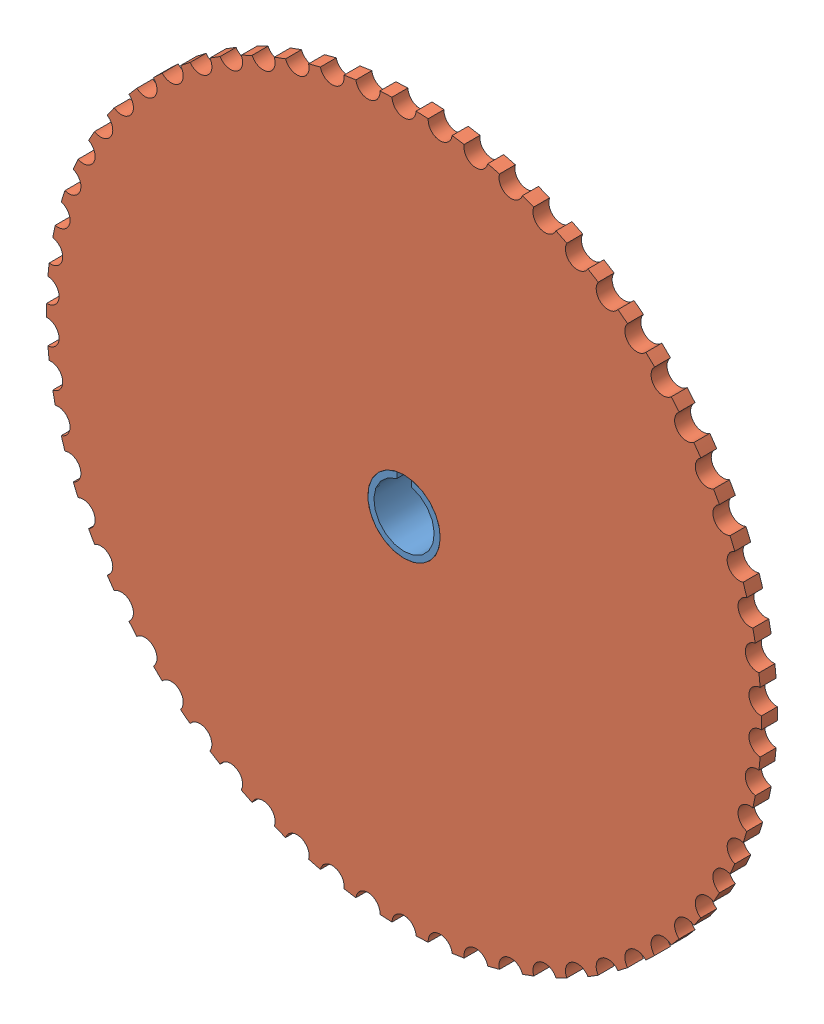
SolidWorks assembly Gear Sub-assembly.SLDASM, configuration Default (file format 4400). Lengths in mm.
Overall size (187.96 187.85 11.81).
3 component instances, 3 part files, 4 mates.
Components (placement in the parent):
- Gear Bracket-1: Gear Bracket.SLDPRT [Default] at (-7.665 3.1375 7.8187) size (38.1 38.1 11.81)
- Gear Assy Weld-1: Gear Assy Weld.SLDPRT [Default] at (-7.665 3.1375 2.8771) x (1 0 0) z (0 1 0) size (42.1 1.5 42.1)
- Gear Driven-1: Gear Driven.SLDPRT [Default] at (-7.665 3.1375 5.7232) size (187.96 187.85 4.19)
Mates (geometry in assembly coordinates):
- Concentric1: concentric aligned: cylinder of Gear Bracket-1 through (-7.665 3.1375 -65.0014) axis (0 0 -1) radius 9.525; cylinder of Gear Driven-1 through (-7.665 3.1375 7.8187) axis (0 0 -1) radius 9.525
- Coincident1: coincident anti-aligned: plane of Gear Bracket-1 through (1.86 3.1375 3.6277) normal (0 0 1); plane of Gear Driven-1 through (-7.665 3.1375 3.6277) normal (0 0 -1)
- Concentric2: concentric anti-aligned: cylinder of Gear Bracket-1 through (-7.665 3.1375 -65.0014) axis (0 0 -1) radius 19.05; cylinder of Gear Assy Weld-1 through (-7.665 3.1375 2.8771) axis (0 0 1) radius 19.05
- Coincident2: coincident anti-aligned: plane of Gear Assy Weld-1 through (-9.519 22.0971 3.6277) normal (0 0 1); plane of Gear Driven-1 through (-7.665 3.1375 3.6277) normal (0 0 -1)
